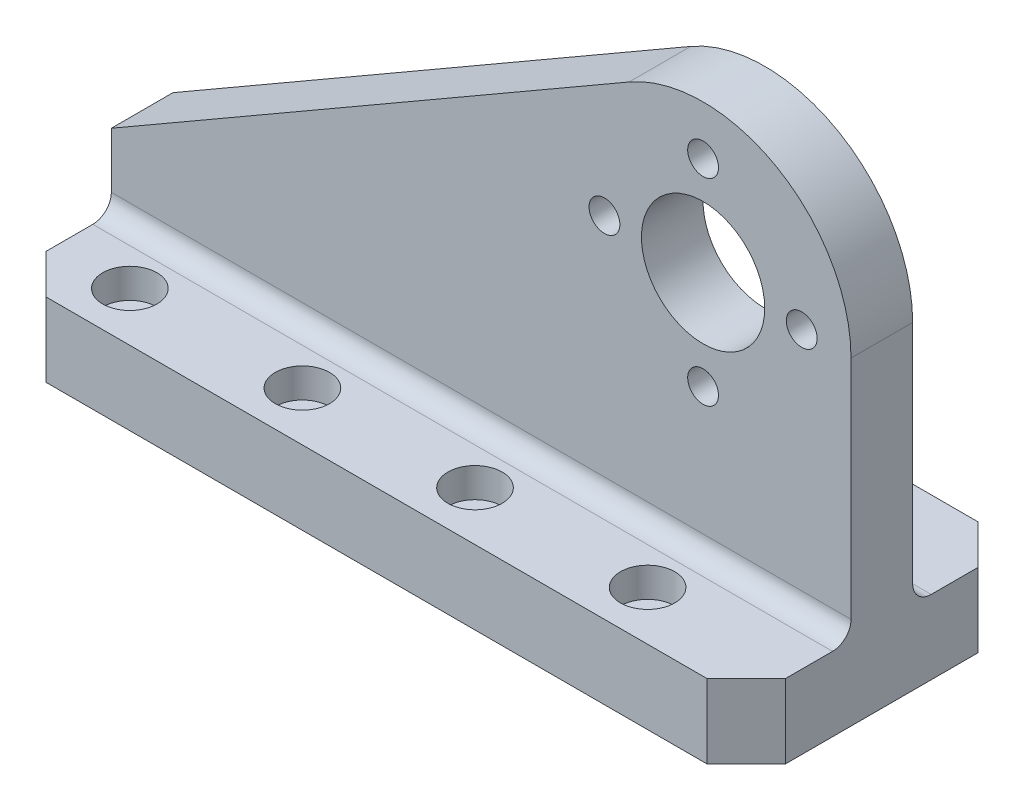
ISO-10303-21;
HEADER;
FILE_DESCRIPTION(('STEP AP214'),'2;1');
FILE_NAME('part.step','',(''),(''),'','','');
FILE_SCHEMA(('AUTOMOTIVE_DESIGN { 1 0 10303 214 1 1 1 1 }'));
ENDSEC;
DATA;
#1=APPLICATION_CONTEXT('core data for automotive mechanical design processes');
#2=APPLICATION_PROTOCOL_DEFINITION('international standard','automotive_design',2000,#1);
#3=PRODUCT_CONTEXT('',#1,'mechanical');
#4=PRODUCT('Part','Part','',(#3));
#5=PRODUCT_RELATED_PRODUCT_CATEGORY('part','',(#4));
#6=PRODUCT_DEFINITION_FORMATION('','',#4);
#7=PRODUCT_DEFINITION_CONTEXT('part definition',#1,'design');
#8=PRODUCT_DEFINITION('design','',#6,#7);
#9=PRODUCT_DEFINITION_SHAPE('','',#8);
#10=(LENGTH_UNIT() NAMED_UNIT(*) SI_UNIT(.MILLI.,.METRE.));
#11=(NAMED_UNIT(*) PLANE_ANGLE_UNIT() SI_UNIT($,.RADIAN.));
#12=(NAMED_UNIT(*) SI_UNIT($,.STERADIAN.) SOLID_ANGLE_UNIT());
#13=UNCERTAINTY_MEASURE_WITH_UNIT(LENGTH_MEASURE(1.E-05),#10,'distance_accuracy_value','');
#14=(GEOMETRIC_REPRESENTATION_CONTEXT(3) GLOBAL_UNCERTAINTY_ASSIGNED_CONTEXT((#13)) GLOBAL_UNIT_ASSIGNED_CONTEXT((#10,
#11,#12)) REPRESENTATION_CONTEXT('',''));
#15=CARTESIAN_POINT('',(0.,0.,0.));
#16=DIRECTION('',(0.,0.,1.));
#17=DIRECTION('',(1.,0.,0.));
#18=AXIS2_PLACEMENT_3D('',#15,#16,#17);
#19=CARTESIAN_POINT('',(6.,6.,7.));
#20=DIRECTION('',(0.,1.,0.));
#21=DIRECTION('',(0.,0.,1.));
#22=AXIS2_PLACEMENT_3D('',#19,#20,#21);
#23=CYLINDRICAL_SURFACE('',#22,2.2);
#24=CARTESIAN_POINT('',(6.,3.6,7.));
#25=DIRECTION('',(0.,1.,0.));
#26=DIRECTION('',(0.,0.,1.));
#27=AXIS2_PLACEMENT_3D('',#24,#25,#26);
#28=CIRCLE('',#27,2.2);
#29=CARTESIAN_POINT('',(6.,3.6,9.2));
#30=VERTEX_POINT('',#29);
#31=EDGE_CURVE('E257',#30,#30,#28,.T.);
#32=ORIENTED_EDGE('',*,*,#31,.F.);
#33=EDGE_LOOP('',(#32));
#34=FACE_BOUND('',#33,.T.);
#35=CARTESIAN_POINT('',(6.,6.,7.));
#36=DIRECTION('',(0.,1.,0.));
#37=DIRECTION('',(0.,0.,1.));
#38=AXIS2_PLACEMENT_3D('',#35,#36,#37);
#39=CIRCLE('',#38,2.2);
#40=CARTESIAN_POINT('',(6.,6.,9.2));
#41=VERTEX_POINT('',#40);
#42=EDGE_CURVE('E248',#41,#41,#39,.T.);
#43=ORIENTED_EDGE('',*,*,#42,.T.);
#44=EDGE_LOOP('',(#43));
#45=FACE_BOUND('',#44,.T.);
#46=ADVANCED_FACE('F48',(#34,#45),#23,.F.);
#47=CARTESIAN_POINT('',(7.2,3.6,7.));
#48=DIRECTION('',(0.,-1.,0.));
#49=DIRECTION('',(0.,0.,-1.));
#50=AXIS2_PLACEMENT_3D('',#47,#48,#49);
#51=PLANE('',#50);
#52=CARTESIAN_POINT('',(6.,3.6,7.));
#53=DIRECTION('',(0.,1.,0.));
#54=DIRECTION('',(0.,0.,1.));
#55=AXIS2_PLACEMENT_3D('',#52,#53,#54);
#56=CIRCLE('',#55,1.2);
#57=CARTESIAN_POINT('',(6.,3.6,8.2));
#58=VERTEX_POINT('',#57);
#59=EDGE_CURVE('E254',#58,#58,#56,.T.);
#60=ORIENTED_EDGE('',*,*,#59,.F.);
#61=EDGE_LOOP('',(#60));
#62=FACE_BOUND('',#61,.T.);
#63=ORIENTED_EDGE('',*,*,#31,.T.);
#64=EDGE_LOOP('',(#63));
#65=FACE_BOUND('',#64,.T.);
#66=ADVANCED_FACE('F372',(#62,#65),#51,.F.);
#67=CARTESIAN_POINT('',(6.,6.,7.));
#68=DIRECTION('',(0.,1.,0.));
#69=DIRECTION('',(0.,0.,1.));
#70=AXIS2_PLACEMENT_3D('',#67,#68,#69);
#71=CYLINDRICAL_SURFACE('',#70,1.2);
#72=CARTESIAN_POINT('',(6.,0.,7.));
#73=DIRECTION('',(0.,1.,0.));
#74=DIRECTION('',(0.,0.,1.));
#75=AXIS2_PLACEMENT_3D('',#72,#73,#74);
#76=CIRCLE('',#75,1.2);
#77=CARTESIAN_POINT('',(6.,0.,8.2));
#78=VERTEX_POINT('',#77);
#79=EDGE_CURVE('E251',#78,#78,#76,.T.);
#80=ORIENTED_EDGE('',*,*,#79,.F.);
#81=EDGE_LOOP('',(#80));
#82=FACE_BOUND('',#81,.T.);
#83=ORIENTED_EDGE('',*,*,#59,.T.);
#84=EDGE_LOOP('',(#83));
#85=FACE_BOUND('',#84,.T.);
#86=ADVANCED_FACE('F378',(#82,#85),#71,.F.);
#87=CARTESIAN_POINT('',(20.,6.,7.));
#88=DIRECTION('',(0.,1.,0.));
#89=DIRECTION('',(0.,0.,1.));
#90=AXIS2_PLACEMENT_3D('',#87,#88,#89);
#91=CYLINDRICAL_SURFACE('',#90,2.2);
#92=CARTESIAN_POINT('',(20.,3.6,7.));
#93=DIRECTION('',(0.,1.,0.));
#94=DIRECTION('',(0.,0.,1.));
#95=AXIS2_PLACEMENT_3D('',#92,#93,#94);
#96=CIRCLE('',#95,2.2);
#97=CARTESIAN_POINT('',(20.,3.6,9.2));
#98=VERTEX_POINT('',#97);
#99=EDGE_CURVE('E245',#98,#98,#96,.T.);
#100=ORIENTED_EDGE('',*,*,#99,.F.);
#101=EDGE_LOOP('',(#100));
#102=FACE_BOUND('',#101,.T.);
#103=CARTESIAN_POINT('',(20.,6.,7.));
#104=DIRECTION('',(0.,1.,0.));
#105=DIRECTION('',(0.,0.,1.));
#106=AXIS2_PLACEMENT_3D('',#103,#104,#105);
#107=CIRCLE('',#106,2.2);
#108=CARTESIAN_POINT('',(20.,6.,9.2));
#109=VERTEX_POINT('',#108);
#110=EDGE_CURVE('E236',#109,#109,#107,.T.);
#111=ORIENTED_EDGE('',*,*,#110,.T.);
#112=EDGE_LOOP('',(#111));
#113=FACE_BOUND('',#112,.T.);
#114=ADVANCED_FACE('F524',(#102,#113),#91,.F.);
#115=CARTESIAN_POINT('',(21.2,3.6,7.));
#116=DIRECTION('',(0.,-1.,0.));
#117=DIRECTION('',(0.,0.,-1.));
#118=AXIS2_PLACEMENT_3D('',#115,#116,#117);
#119=PLANE('',#118);
#120=CARTESIAN_POINT('',(20.,3.6,7.));
#121=DIRECTION('',(0.,1.,0.));
#122=DIRECTION('',(0.,0.,1.));
#123=AXIS2_PLACEMENT_3D('',#120,#121,#122);
#124=CIRCLE('',#123,1.2);
#125=CARTESIAN_POINT('',(20.,3.6,8.2));
#126=VERTEX_POINT('',#125);
#127=EDGE_CURVE('E242',#126,#126,#124,.T.);
#128=ORIENTED_EDGE('',*,*,#127,.F.);
#129=EDGE_LOOP('',(#128));
#130=FACE_BOUND('',#129,.T.);
#131=ORIENTED_EDGE('',*,*,#99,.T.);
#132=EDGE_LOOP('',(#131));
#133=FACE_BOUND('',#132,.T.);
#134=ADVANCED_FACE('F520',(#130,#133),#119,.F.);
#135=CARTESIAN_POINT('',(20.,6.,7.));
#136=DIRECTION('',(0.,1.,0.));
#137=DIRECTION('',(0.,0.,1.));
#138=AXIS2_PLACEMENT_3D('',#135,#136,#137);
#139=CYLINDRICAL_SURFACE('',#138,1.2);
#140=CARTESIAN_POINT('',(20.,0.,7.));
#141=DIRECTION('',(0.,1.,0.));
#142=DIRECTION('',(0.,0.,1.));
#143=AXIS2_PLACEMENT_3D('',#140,#141,#142);
#144=CIRCLE('',#143,1.2);
#145=CARTESIAN_POINT('',(20.,0.,8.2));
#146=VERTEX_POINT('',#145);
#147=EDGE_CURVE('E239',#146,#146,#144,.T.);
#148=ORIENTED_EDGE('',*,*,#147,.F.);
#149=EDGE_LOOP('',(#148));
#150=FACE_BOUND('',#149,.T.);
#151=ORIENTED_EDGE('',*,*,#127,.T.);
#152=EDGE_LOOP('',(#151));
#153=FACE_BOUND('',#152,.T.);
#154=ADVANCED_FACE('F496',(#150,#153),#139,.F.);
#155=CARTESIAN_POINT('',(48.,25.8564064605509,2.5));
#156=DIRECTION('',(0.,0.,1.));
#157=DIRECTION('',(1.,0.,0.));
#158=AXIS2_PLACEMENT_3D('',#155,#156,#157);
#159=PLANE('',#158);
#160=CARTESIAN_POINT('',(48.0000000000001,17.8564064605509,2.5));
#161=DIRECTION('',(0.,0.,1.));
#162=DIRECTION('',(1.,0.,0.));
#163=AXIS2_PLACEMENT_3D('',#160,#161,#162);
#164=CIRCLE('',#163,1.24999999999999);
#165=CARTESIAN_POINT('',(49.2500000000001,17.8564064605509,2.5));
#166=VERTEX_POINT('',#165);
#167=EDGE_CURVE('E265',#166,#166,#164,.T.);
#168=ORIENTED_EDGE('',*,*,#167,.F.);
#169=EDGE_LOOP('',(#168));
#170=FACE_BOUND('',#169,.T.);
#171=CARTESIAN_POINT('',(40.,25.8564064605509,2.5));
#172=DIRECTION('',(0.,0.,1.));
#173=DIRECTION('',(1.,0.,0.));
#174=AXIS2_PLACEMENT_3D('',#171,#172,#173);
#175=CIRCLE('',#174,1.24999999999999);
#176=CARTESIAN_POINT('',(41.25,25.8564064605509,2.5));
#177=VERTEX_POINT('',#176);
#178=EDGE_CURVE('E264',#177,#177,#175,.T.);
#179=ORIENTED_EDGE('',*,*,#178,.F.);
#180=EDGE_LOOP('',(#179));
#181=FACE_BOUND('',#180,.T.);
#182=CARTESIAN_POINT('',(48.,33.8564064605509,2.5));
#183=DIRECTION('',(0.,0.,1.));
#184=DIRECTION('',(1.,0.,0.));
#185=AXIS2_PLACEMENT_3D('',#182,#183,#184);
#186=CIRCLE('',#185,1.24999999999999);
#187=CARTESIAN_POINT('',(49.25,33.8564064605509,2.5));
#188=VERTEX_POINT('',#187);
#189=EDGE_CURVE('E917',#188,#188,#186,.T.);
#190=ORIENTED_EDGE('',*,*,#189,.F.);
#191=EDGE_LOOP('',(#190));
#192=FACE_BOUND('',#191,.T.);
#193=CARTESIAN_POINT('',(56.,25.8564064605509,2.5));
#194=DIRECTION('',(0.,0.,1.));
#195=DIRECTION('',(1.,0.,0.));
#196=AXIS2_PLACEMENT_3D('',#193,#194,#195);
#197=CIRCLE('',#196,1.24999999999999);
#198=CARTESIAN_POINT('',(57.25,25.8564064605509,2.5));
#199=VERTEX_POINT('',#198);
#200=EDGE_CURVE('E911',#199,#199,#197,.T.);
#201=ORIENTED_EDGE('',*,*,#200,.F.);
#202=EDGE_LOOP('',(#201));
#203=FACE_BOUND('',#202,.T.);
#204=DIRECTION('',(0.,-1.,0.));
#205=VECTOR('',#204,1.);
#206=CARTESIAN_POINT('',(0.,12.,2.5));
#207=LINE('',#206,#205);
#208=CARTESIAN_POINT('',(0.,12.,2.5));
#209=VERTEX_POINT('',#208);
#210=CARTESIAN_POINT('',(0.,7.5,2.5));
#211=VERTEX_POINT('',#210);
#212=EDGE_CURVE('E160',#209,#211,#207,.T.);
#213=ORIENTED_EDGE('',*,*,#212,.T.);
#214=DIRECTION('',(-1.,0.,0.));
#215=VECTOR('',#214,1.);
#216=CARTESIAN_POINT('',(60.,7.5,2.5));
#217=LINE('',#216,#215);
#218=CARTESIAN_POINT('',(60.,7.5,2.5));
#219=VERTEX_POINT('',#218);
#220=EDGE_CURVE('E69',#211,#219,#217,.F.);
#221=ORIENTED_EDGE('',*,*,#220,.T.);
#222=DIRECTION('',(0.,1.,0.));
#223=VECTOR('',#222,1.);
#224=CARTESIAN_POINT('',(60.,0.,2.5));
#225=LINE('',#224,#223);
#226=CARTESIAN_POINT('',(60.,25.8564064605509,2.5));
#227=VERTEX_POINT('',#226);
#228=EDGE_CURVE('E151',#219,#227,#225,.T.);
#229=ORIENTED_EDGE('',*,*,#228,.T.);
#230=CARTESIAN_POINT('',(48.,25.8564064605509,2.5));
#231=DIRECTION('',(0.,0.,1.));
#232=DIRECTION('',(1.,0.,0.));
#233=AXIS2_PLACEMENT_3D('',#230,#231,#232);
#234=CIRCLE('',#233,12.);
#235=CARTESIAN_POINT('',(42.,36.2487113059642,2.5));
#236=VERTEX_POINT('',#235);
#237=EDGE_CURVE('E156',#227,#236,#234,.T.);
#238=ORIENTED_EDGE('',*,*,#237,.T.);
#239=DIRECTION('',(-0.86602540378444,-0.499999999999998,0.));
#240=VECTOR('',#239,1.);
#241=CARTESIAN_POINT('',(42.,36.2487113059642,2.5));
#242=LINE('',#241,#240);
#243=EDGE_CURVE('E176',#236,#209,#242,.T.);
#244=ORIENTED_EDGE('',*,*,#243,.T.);
#245=EDGE_LOOP('',(#213,#221,#229,#238,#244));
#246=FACE_BOUND('',#245,.T.);
#247=CARTESIAN_POINT('',(48.,25.8564064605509,2.5));
#248=DIRECTION('',(0.,0.,1.));
#249=DIRECTION('',(1.,0.,0.));
#250=AXIS2_PLACEMENT_3D('',#247,#248,#249);
#251=CIRCLE('',#250,5.);
#252=CARTESIAN_POINT('',(53.,25.8564064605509,2.5));
#253=VERTEX_POINT('',#252);
#254=EDGE_CURVE('E185',#253,#253,#251,.T.);
#255=ORIENTED_EDGE('',*,*,#254,.F.);
#256=EDGE_LOOP('',(#255));
#257=FACE_BOUND('',#256,.T.);
#258=ADVANCED_FACE('F153',(#170,#181,#192,#203,#246,#257),#159,.T.);
#259=CARTESIAN_POINT('',(48.,25.8564064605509,-2.5));
#260=DIRECTION('',(0.,0.,1.));
#261=DIRECTION('',(1.,0.,0.));
#262=AXIS2_PLACEMENT_3D('',#259,#260,#261);
#263=PLANE('',#262);
#264=CARTESIAN_POINT('',(48.0000000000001,17.8564064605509,-2.5));
#265=DIRECTION('',(0.,0.,1.));
#266=DIRECTION('',(1.,0.,0.));
#267=AXIS2_PLACEMENT_3D('',#264,#265,#266);
#268=CIRCLE('',#267,1.24999999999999);
#269=CARTESIAN_POINT('',(49.2500000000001,17.8564064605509,-2.5));
#270=VERTEX_POINT('',#269);
#271=EDGE_CURVE('E261',#270,#270,#268,.T.);
#272=ORIENTED_EDGE('',*,*,#271,.T.);
#273=EDGE_LOOP('',(#272));
#274=FACE_BOUND('',#273,.T.);
#275=CARTESIAN_POINT('',(40.,25.8564064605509,-2.5));
#276=DIRECTION('',(0.,0.,1.));
#277=DIRECTION('',(1.,0.,0.));
#278=AXIS2_PLACEMENT_3D('',#275,#276,#277);
#279=CIRCLE('',#278,1.24999999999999);
#280=CARTESIAN_POINT('',(41.25,25.8564064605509,-2.5));
#281=VERTEX_POINT('',#280);
#282=EDGE_CURVE('E920',#281,#281,#279,.T.);
#283=ORIENTED_EDGE('',*,*,#282,.T.);
#284=EDGE_LOOP('',(#283));
#285=FACE_BOUND('',#284,.T.);
#286=CARTESIAN_POINT('',(48.,33.8564064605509,-2.5));
#287=DIRECTION('',(0.,0.,1.));
#288=DIRECTION('',(1.,0.,0.));
#289=AXIS2_PLACEMENT_3D('',#286,#287,#288);
#290=CIRCLE('',#289,1.24999999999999);
#291=CARTESIAN_POINT('',(49.25,33.8564064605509,-2.5));
#292=VERTEX_POINT('',#291);
#293=EDGE_CURVE('E914',#292,#292,#290,.T.);
#294=ORIENTED_EDGE('',*,*,#293,.T.);
#295=EDGE_LOOP('',(#294));
#296=FACE_BOUND('',#295,.T.);
#297=CARTESIAN_POINT('',(56.,25.8564064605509,-2.5));
#298=DIRECTION('',(0.,0.,1.));
#299=DIRECTION('',(1.,0.,0.));
#300=AXIS2_PLACEMENT_3D('',#297,#298,#299);
#301=CIRCLE('',#300,1.24999999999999);
#302=CARTESIAN_POINT('',(57.25,25.8564064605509,-2.5));
#303=VERTEX_POINT('',#302);
#304=EDGE_CURVE('E908',#303,#303,#301,.T.);
#305=ORIENTED_EDGE('',*,*,#304,.T.);
#306=EDGE_LOOP('',(#305));
#307=FACE_BOUND('',#306,.T.);
#308=DIRECTION('',(0.,1.,0.));
#309=VECTOR('',#308,1.);
#310=CARTESIAN_POINT('',(60.,0.,-2.5));
#311=LINE('',#310,#309);
#312=CARTESIAN_POINT('',(60.,7.5,-2.5));
#313=VERTEX_POINT('',#312);
#314=CARTESIAN_POINT('',(60.,25.8564064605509,-2.5));
#315=VERTEX_POINT('',#314);
#316=EDGE_CURVE('E167',#313,#315,#311,.T.);
#317=ORIENTED_EDGE('',*,*,#316,.F.);
#318=DIRECTION('',(-1.,0.,0.));
#319=VECTOR('',#318,1.);
#320=CARTESIAN_POINT('',(48.,7.5,-2.5));
#321=LINE('',#320,#319);
#322=CARTESIAN_POINT('',(0.,7.5,-2.5));
#323=VERTEX_POINT('',#322);
#324=EDGE_CURVE('E260',#313,#323,#321,.T.);
#325=ORIENTED_EDGE('',*,*,#324,.T.);
#326=DIRECTION('',(0.,-1.,0.));
#327=VECTOR('',#326,1.);
#328=CARTESIAN_POINT('',(0.,12.,-2.5));
#329=LINE('',#328,#327);
#330=CARTESIAN_POINT('',(0.,12.,-2.5));
#331=VERTEX_POINT('',#330);
#332=EDGE_CURVE('E182',#331,#323,#329,.T.);
#333=ORIENTED_EDGE('',*,*,#332,.F.);
#334=DIRECTION('',(-0.86602540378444,-0.499999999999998,0.));
#335=VECTOR('',#334,1.);
#336=CARTESIAN_POINT('',(42.,36.2487113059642,-2.5));
#337=LINE('',#336,#335);
#338=CARTESIAN_POINT('',(42.,36.2487113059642,-2.5));
#339=VERTEX_POINT('',#338);
#340=EDGE_CURVE('E189',#339,#331,#337,.T.);
#341=ORIENTED_EDGE('',*,*,#340,.F.);
#342=CARTESIAN_POINT('',(48.,25.8564064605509,-2.5));
#343=DIRECTION('',(0.,0.,1.));
#344=DIRECTION('',(1.,0.,0.));
#345=AXIS2_PLACEMENT_3D('',#342,#343,#344);
#346=CIRCLE('',#345,12.);
#347=EDGE_CURVE('E187',#315,#339,#346,.T.);
#348=ORIENTED_EDGE('',*,*,#347,.F.);
#349=EDGE_LOOP('',(#317,#325,#333,#341,#348));
#350=FACE_BOUND('',#349,.T.);
#351=CARTESIAN_POINT('',(48.,25.8564064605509,-2.5));
#352=DIRECTION('',(0.,0.,1.));
#353=DIRECTION('',(1.,0.,0.));
#354=AXIS2_PLACEMENT_3D('',#351,#352,#353);
#355=CIRCLE('',#354,5.);
#356=CARTESIAN_POINT('',(53.,25.8564064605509,-2.5));
#357=VERTEX_POINT('',#356);
#358=EDGE_CURVE('E313',#357,#357,#355,.T.);
#359=ORIENTED_EDGE('',*,*,#358,.T.);
#360=EDGE_LOOP('',(#359));
#361=FACE_BOUND('',#360,.T.);
#362=ADVANCED_FACE('F284',(#274,#285,#296,#307,#350,#361),#263,.F.);
#363=CARTESIAN_POINT('',(0.,12.,2.5));
#364=DIRECTION('',(1.,0.,0.));
#365=DIRECTION('',(0.,1.,0.));
#366=AXIS2_PLACEMENT_3D('',#363,#364,#365);
#367=PLANE('',#366);
#368=DIRECTION('',(0.,0.,1.));
#369=VECTOR('',#368,1.);
#370=CARTESIAN_POINT('',(0.,6.,-11.));
#371=LINE('',#370,#369);
#372=CARTESIAN_POINT('',(0.,6.,-7.79999999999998));
#373=VERTEX_POINT('',#372);
#374=CARTESIAN_POINT('',(0.,6.,-4.));
#375=VERTEX_POINT('',#374);
#376=EDGE_CURVE('E292',#373,#375,#371,.T.);
#377=ORIENTED_EDGE('',*,*,#376,.F.);
#378=DIRECTION('',(0.,-1.,0.));
#379=VECTOR('',#378,1.);
#380=CARTESIAN_POINT('',(0.,12.,-7.79999999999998));
#381=LINE('',#380,#379);
#382=CARTESIAN_POINT('',(0.,0.,-7.79999999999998));
#383=VERTEX_POINT('',#382);
#384=EDGE_CURVE('E201',#373,#383,#381,.T.);
#385=ORIENTED_EDGE('',*,*,#384,.T.);
#386=DIRECTION('',(0.,0.,-1.));
#387=VECTOR('',#386,1.);
#388=CARTESIAN_POINT('',(0.,0.,2.5));
#389=LINE('',#388,#387);
#390=CARTESIAN_POINT('',(0.,0.,7.79999999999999));
#391=VERTEX_POINT('',#390);
#392=EDGE_CURVE('E195',#391,#383,#389,.T.);
#393=ORIENTED_EDGE('',*,*,#392,.F.);
#394=DIRECTION('',(0.,1.,0.));
#395=VECTOR('',#394,1.);
#396=CARTESIAN_POINT('',(0.,12.,7.79999999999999));
#397=LINE('',#396,#395);
#398=CARTESIAN_POINT('',(0.,6.,7.79999999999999));
#399=VERTEX_POINT('',#398);
#400=EDGE_CURVE('E198',#391,#399,#397,.T.);
#401=ORIENTED_EDGE('',*,*,#400,.T.);
#402=CARTESIAN_POINT('',(0.,6.,4.));
#403=VERTEX_POINT('',#402);
#404=EDGE_CURVE('E299',#403,#399,#371,.T.);
#405=ORIENTED_EDGE('',*,*,#404,.F.);
#406=CARTESIAN_POINT('',(0.,7.5,4.));
#407=DIRECTION('',(1.,0.,0.));
#408=DIRECTION('',(0.,1.,0.));
#409=AXIS2_PLACEMENT_3D('',#406,#407,#408);
#410=CIRCLE('',#409,1.5);
#411=EDGE_CURVE('E56',#403,#211,#410,.T.);
#412=ORIENTED_EDGE('',*,*,#411,.T.);
#413=ORIENTED_EDGE('',*,*,#212,.F.);
#414=DIRECTION('',(0.,0.,-1.));
#415=VECTOR('',#414,1.);
#416=CARTESIAN_POINT('',(0.,12.,2.5));
#417=LINE('',#416,#415);
#418=EDGE_CURVE('E178',#209,#331,#417,.T.);
#419=ORIENTED_EDGE('',*,*,#418,.T.);
#420=ORIENTED_EDGE('',*,*,#332,.T.);
#421=CARTESIAN_POINT('',(0.,7.5,-4.));
#422=DIRECTION('',(1.,0.,0.));
#423=DIRECTION('',(0.,1.,0.));
#424=AXIS2_PLACEMENT_3D('',#421,#422,#423);
#425=CIRCLE('',#424,1.5);
#426=EDGE_CURVE('E274',#323,#375,#425,.T.);
#427=ORIENTED_EDGE('',*,*,#426,.T.);
#428=EDGE_LOOP('',(#377,#385,#393,#401,#405,#412,#413,#419,#420,#427));
#429=FACE_BOUND('',#428,.T.);
#430=ADVANCED_FACE('F291',(#429),#367,.F.);
#431=CARTESIAN_POINT('',(0.,0.,2.5));
#432=DIRECTION('',(0.,1.,0.));
#433=DIRECTION('',(0.,0.,1.));
#434=AXIS2_PLACEMENT_3D('',#431,#432,#433);
#435=PLANE('',#434);
#436=CARTESIAN_POINT('',(6.,0.,-7.));
#437=DIRECTION('',(0.,1.,0.));
#438=DIRECTION('',(0.,0.,1.));
#439=AXIS2_PLACEMENT_3D('',#436,#437,#438);
#440=CIRCLE('',#439,1.2);
#441=CARTESIAN_POINT('',(6.,0.,-5.8));
#442=VERTEX_POINT('',#441);
#443=EDGE_CURVE('E828',#442,#442,#440,.T.);
#444=ORIENTED_EDGE('',*,*,#443,.T.);
#445=EDGE_LOOP('',(#444));
#446=FACE_BOUND('',#445,.T.);
#447=CARTESIAN_POINT('',(20.,0.,-7.));
#448=DIRECTION('',(0.,1.,0.));
#449=DIRECTION('',(0.,0.,1.));
#450=AXIS2_PLACEMENT_3D('',#447,#448,#449);
#451=CIRCLE('',#450,1.2);
#452=CARTESIAN_POINT('',(20.,0.,-5.8));
#453=VERTEX_POINT('',#452);
#454=EDGE_CURVE('E832',#453,#453,#451,.T.);
#455=ORIENTED_EDGE('',*,*,#454,.T.);
#456=EDGE_LOOP('',(#455));
#457=FACE_BOUND('',#456,.T.);
#458=CARTESIAN_POINT('',(34.,0.,-7.));
#459=DIRECTION('',(0.,1.,0.));
#460=DIRECTION('',(0.,0.,1.));
#461=AXIS2_PLACEMENT_3D('',#458,#459,#460);
#462=CIRCLE('',#461,1.2);
#463=CARTESIAN_POINT('',(34.,0.,-5.8));
#464=VERTEX_POINT('',#463);
#465=EDGE_CURVE('E836',#464,#464,#462,.T.);
#466=ORIENTED_EDGE('',*,*,#465,.T.);
#467=EDGE_LOOP('',(#466));
#468=FACE_BOUND('',#467,.T.);
#469=CARTESIAN_POINT('',(48.,0.,-7.));
#470=DIRECTION('',(0.,1.,0.));
#471=DIRECTION('',(0.,0.,1.));
#472=AXIS2_PLACEMENT_3D('',#469,#470,#471);
#473=CIRCLE('',#472,1.2);
#474=CARTESIAN_POINT('',(48.,0.,-5.8));
#475=VERTEX_POINT('',#474);
#476=EDGE_CURVE('E840',#475,#475,#473,.T.);
#477=ORIENTED_EDGE('',*,*,#476,.T.);
#478=EDGE_LOOP('',(#477));
#479=FACE_BOUND('',#478,.T.);
#480=CARTESIAN_POINT('',(34.,0.,7.));
#481=DIRECTION('',(0.,1.,0.));
#482=DIRECTION('',(0.,0.,1.));
#483=AXIS2_PLACEMENT_3D('',#480,#481,#482);
#484=CIRCLE('',#483,1.2);
#485=CARTESIAN_POINT('',(34.,0.,8.2));
#486=VERTEX_POINT('',#485);
#487=EDGE_CURVE('E844',#486,#486,#484,.T.);
#488=ORIENTED_EDGE('',*,*,#487,.T.);
#489=EDGE_LOOP('',(#488));
#490=FACE_BOUND('',#489,.T.);
#491=CARTESIAN_POINT('',(48.,0.,7.));
#492=DIRECTION('',(0.,1.,0.));
#493=DIRECTION('',(0.,0.,1.));
#494=AXIS2_PLACEMENT_3D('',#491,#492,#493);
#495=CIRCLE('',#494,1.2);
#496=CARTESIAN_POINT('',(48.,0.,8.2));
#497=VERTEX_POINT('',#496);
#498=EDGE_CURVE('E305',#497,#497,#495,.T.);
#499=ORIENTED_EDGE('',*,*,#498,.T.);
#500=EDGE_LOOP('',(#499));
#501=FACE_BOUND('',#500,.T.);
#502=ORIENTED_EDGE('',*,*,#392,.T.);
#503=DIRECTION('',(-0.707106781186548,0.,0.707106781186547));
#504=VECTOR('',#503,1.);
#505=CARTESIAN_POINT('',(0.,0.,-7.79999999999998));
#506=LINE('',#505,#504);
#507=CARTESIAN_POINT('',(3.20000000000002,0.,-11.));
#508=VERTEX_POINT('',#507);
#509=EDGE_CURVE('E210',#383,#508,#506,.F.);
#510=ORIENTED_EDGE('',*,*,#509,.T.);
#511=DIRECTION('',(-1.,0.,0.));
#512=VECTOR('',#511,1.);
#513=CARTESIAN_POINT('',(0.,0.,-11.));
#514=LINE('',#513,#512);
#515=CARTESIAN_POINT('',(56.8,0.,-11.));
#516=VERTEX_POINT('',#515);
#517=EDGE_CURVE('E303',#516,#508,#514,.T.);
#518=ORIENTED_EDGE('',*,*,#517,.F.);
#519=DIRECTION('',(-0.707106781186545,0.,-0.70710678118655));
#520=VECTOR('',#519,1.);
#521=CARTESIAN_POINT('',(56.8,0.,-11.));
#522=LINE('',#521,#520);
#523=CARTESIAN_POINT('',(60.,0.,-7.8));
#524=VERTEX_POINT('',#523);
#525=EDGE_CURVE('E208',#516,#524,#522,.F.);
#526=ORIENTED_EDGE('',*,*,#525,.T.);
#527=DIRECTION('',(0.,0.,-1.));
#528=VECTOR('',#527,1.);
#529=CARTESIAN_POINT('',(60.,0.,2.5));
#530=LINE('',#529,#528);
#531=CARTESIAN_POINT('',(60.,0.,7.79999999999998));
#532=VERTEX_POINT('',#531);
#533=EDGE_CURVE('E170',#532,#524,#530,.T.);
#534=ORIENTED_EDGE('',*,*,#533,.F.);
#535=DIRECTION('',(0.707106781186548,0.,-0.707106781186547));
#536=VECTOR('',#535,1.);
#537=CARTESIAN_POINT('',(60.,0.,7.79999999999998));
#538=LINE('',#537,#536);
#539=CARTESIAN_POINT('',(56.8,0.,11.));
#540=VERTEX_POINT('',#539);
#541=EDGE_CURVE('E204',#532,#540,#538,.F.);
#542=ORIENTED_EDGE('',*,*,#541,.T.);
#543=DIRECTION('',(1.,0.,0.));
#544=VECTOR('',#543,1.);
#545=CARTESIAN_POINT('',(0.,0.,11.));
#546=LINE('',#545,#544);
#547=CARTESIAN_POINT('',(3.19999999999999,0.,11.));
#548=VERTEX_POINT('',#547);
#549=EDGE_CURVE('E314',#548,#540,#546,.T.);
#550=ORIENTED_EDGE('',*,*,#549,.F.);
#551=DIRECTION('',(0.707106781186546,0.,0.707106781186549));
#552=VECTOR('',#551,1.);
#553=CARTESIAN_POINT('',(3.19999999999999,0.,11.));
#554=LINE('',#553,#552);
#555=EDGE_CURVE('E206',#548,#391,#554,.F.);
#556=ORIENTED_EDGE('',*,*,#555,.T.);
#557=EDGE_LOOP('',(#502,#510,#518,#526,#534,#542,#550,#556));
#558=FACE_BOUND('',#557,.T.);
#559=ORIENTED_EDGE('',*,*,#147,.T.);
#560=EDGE_LOOP('',(#559));
#561=FACE_BOUND('',#560,.T.);
#562=ORIENTED_EDGE('',*,*,#79,.T.);
#563=EDGE_LOOP('',(#562));
#564=FACE_BOUND('',#563,.T.);
#565=ADVANCED_FACE('F338',(#446,#457,#468,#479,#490,#501,#558,#561,#564),#435,.F.);
#566=CARTESIAN_POINT('',(60.,0.,2.5));
#567=DIRECTION('',(-1.,0.,0.));
#568=DIRECTION('',(0.,0.,1.));
#569=AXIS2_PLACEMENT_3D('',#566,#567,#568);
#570=PLANE('',#569);
#571=ORIENTED_EDGE('',*,*,#533,.T.);
#572=DIRECTION('',(0.,1.,0.));
#573=VECTOR('',#572,1.);
#574=CARTESIAN_POINT('',(60.,0.,-7.8));
#575=LINE('',#574,#573);
#576=CARTESIAN_POINT('',(60.,6.,-7.8));
#577=VERTEX_POINT('',#576);
#578=EDGE_CURVE('E224',#524,#577,#575,.T.);
#579=ORIENTED_EDGE('',*,*,#578,.T.);
#580=DIRECTION('',(0.,0.,-1.));
#581=VECTOR('',#580,1.);
#582=CARTESIAN_POINT('',(60.,6.,-11.));
#583=LINE('',#582,#581);
#584=CARTESIAN_POINT('',(60.,6.,-4.));
#585=VERTEX_POINT('',#584);
#586=EDGE_CURVE('E279',#585,#577,#583,.T.);
#587=ORIENTED_EDGE('',*,*,#586,.F.);
#588=CARTESIAN_POINT('',(60.,7.5,-4.));
#589=DIRECTION('',(-1.,0.,0.));
#590=DIRECTION('',(0.,0.,1.));
#591=AXIS2_PLACEMENT_3D('',#588,#589,#590);
#592=CIRCLE('',#591,1.5);
#593=EDGE_CURVE('E276',#585,#313,#592,.T.);
#594=ORIENTED_EDGE('',*,*,#593,.T.);
#595=ORIENTED_EDGE('',*,*,#316,.T.);
#596=DIRECTION('',(0.,0.,-1.));
#597=VECTOR('',#596,1.);
#598=CARTESIAN_POINT('',(60.,25.8564064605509,2.5));
#599=LINE('',#598,#597);
#600=EDGE_CURVE('E163',#227,#315,#599,.T.);
#601=ORIENTED_EDGE('',*,*,#600,.F.);
#602=ORIENTED_EDGE('',*,*,#228,.F.);
#603=CARTESIAN_POINT('',(60.,7.5,4.));
#604=DIRECTION('',(-1.,0.,0.));
#605=DIRECTION('',(0.,0.,1.));
#606=AXIS2_PLACEMENT_3D('',#603,#604,#605);
#607=CIRCLE('',#606,1.5);
#608=CARTESIAN_POINT('',(60.,6.,4.));
#609=VERTEX_POINT('',#608);
#610=EDGE_CURVE('E13',#219,#609,#607,.T.);
#611=ORIENTED_EDGE('',*,*,#610,.T.);
#612=CARTESIAN_POINT('',(60.,6.,7.79999999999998));
#613=VERTEX_POINT('',#612);
#614=EDGE_CURVE('E308',#613,#609,#583,.T.);
#615=ORIENTED_EDGE('',*,*,#614,.F.);
#616=DIRECTION('',(0.,-1.,0.));
#617=VECTOR('',#616,1.);
#618=CARTESIAN_POINT('',(60.,0.,7.79999999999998));
#619=LINE('',#618,#617);
#620=EDGE_CURVE('E221',#613,#532,#619,.T.);
#621=ORIENTED_EDGE('',*,*,#620,.T.);
#622=EDGE_LOOP('',(#571,#579,#587,#594,#595,#601,#602,#611,#615,#621));
#623=FACE_BOUND('',#622,.T.);
#624=ADVANCED_FACE('F165',(#623),#570,.F.);
#625=CARTESIAN_POINT('',(48.,25.8564064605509,2.5));
#626=DIRECTION('',(0.,0.,-1.));
#627=DIRECTION('',(-1.,0.,0.));
#628=AXIS2_PLACEMENT_3D('',#625,#626,#627);
#629=CYLINDRICAL_SURFACE('',#628,12.);
#630=ORIENTED_EDGE('',*,*,#347,.T.);
#631=DIRECTION('',(0.,0.,-1.));
#632=VECTOR('',#631,1.);
#633=CARTESIAN_POINT('',(42.,36.2487113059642,2.5));
#634=LINE('',#633,#632);
#635=EDGE_CURVE('E171',#236,#339,#634,.T.);
#636=ORIENTED_EDGE('',*,*,#635,.F.);
#637=ORIENTED_EDGE('',*,*,#237,.F.);
#638=ORIENTED_EDGE('',*,*,#600,.T.);
#639=EDGE_LOOP('',(#630,#636,#637,#638));
#640=FACE_BOUND('',#639,.T.);
#641=ADVANCED_FACE('F173',(#640),#629,.T.);
#642=CARTESIAN_POINT('',(42.,36.2487113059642,2.5));
#643=DIRECTION('',(0.499999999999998,-0.86602540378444,0.));
#644=DIRECTION('',(0.86602540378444,0.499999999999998,0.));
#645=AXIS2_PLACEMENT_3D('',#642,#643,#644);
#646=PLANE('',#645);
#647=ORIENTED_EDGE('',*,*,#340,.T.);
#648=ORIENTED_EDGE('',*,*,#418,.F.);
#649=ORIENTED_EDGE('',*,*,#243,.F.);
#650=ORIENTED_EDGE('',*,*,#635,.T.);
#651=EDGE_LOOP('',(#647,#648,#649,#650));
#652=FACE_BOUND('',#651,.T.);
#653=ADVANCED_FACE('F485',(#652),#646,.F.);
#654=CARTESIAN_POINT('',(48.,25.8564064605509,2.5));
#655=DIRECTION('',(0.,0.,-1.));
#656=DIRECTION('',(-1.,0.,0.));
#657=AXIS2_PLACEMENT_3D('',#654,#655,#656);
#658=CYLINDRICAL_SURFACE('',#657,5.);
#659=ORIENTED_EDGE('',*,*,#254,.T.);
#660=EDGE_LOOP('',(#659));
#661=FACE_BOUND('',#660,.T.);
#662=ORIENTED_EDGE('',*,*,#358,.F.);
#663=EDGE_LOOP('',(#662));
#664=FACE_BOUND('',#663,.T.);
#665=ADVANCED_FACE('F481',(#661,#664),#658,.F.);
#666=CARTESIAN_POINT('',(0.,6.,-11.));
#667=DIRECTION('',(0.,0.,1.));
#668=DIRECTION('',(1.,0.,0.));
#669=AXIS2_PLACEMENT_3D('',#666,#667,#668);
#670=PLANE('',#669);
#671=ORIENTED_EDGE('',*,*,#517,.T.);
#672=DIRECTION('',(0.,1.,0.));
#673=VECTOR('',#672,1.);
#674=CARTESIAN_POINT('',(3.20000000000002,6.,-11.));
#675=LINE('',#674,#673);
#676=CARTESIAN_POINT('',(3.20000000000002,6.,-11.));
#677=VERTEX_POINT('',#676);
#678=EDGE_CURVE('E215',#508,#677,#675,.T.);
#679=ORIENTED_EDGE('',*,*,#678,.T.);
#680=DIRECTION('',(-1.,0.,0.));
#681=VECTOR('',#680,1.);
#682=CARTESIAN_POINT('',(0.,6.,-11.));
#683=LINE('',#682,#681);
#684=CARTESIAN_POINT('',(56.8,6.,-11.));
#685=VERTEX_POINT('',#684);
#686=EDGE_CURVE('E311',#685,#677,#683,.T.);
#687=ORIENTED_EDGE('',*,*,#686,.F.);
#688=DIRECTION('',(0.,-1.,0.));
#689=VECTOR('',#688,1.);
#690=CARTESIAN_POINT('',(56.8,6.,-11.));
#691=LINE('',#690,#689);
#692=EDGE_CURVE('E212',#685,#516,#691,.T.);
#693=ORIENTED_EDGE('',*,*,#692,.T.);
#694=EDGE_LOOP('',(#671,#679,#687,#693));
#695=FACE_BOUND('',#694,.T.);
#696=ADVANCED_FACE('F348',(#695),#670,.F.);
#697=CARTESIAN_POINT('',(0.,6.,0.));
#698=DIRECTION('',(0.,1.,0.));
#699=DIRECTION('',(0.,0.,1.));
#700=AXIS2_PLACEMENT_3D('',#697,#698,#699);
#701=PLANE('',#700);
#702=CARTESIAN_POINT('',(6.,6.,-7.));
#703=DIRECTION('',(0.,1.,0.));
#704=DIRECTION('',(0.,0.,1.));
#705=AXIS2_PLACEMENT_3D('',#702,#703,#704);
#706=CIRCLE('',#705,2.2);
#707=CARTESIAN_POINT('',(6.,6.,-4.8));
#708=VERTEX_POINT('',#707);
#709=EDGE_CURVE('E905',#708,#708,#706,.T.);
#710=ORIENTED_EDGE('',*,*,#709,.F.);
#711=EDGE_LOOP('',(#710));
#712=FACE_BOUND('',#711,.T.);
#713=CARTESIAN_POINT('',(20.,6.,-7.));
#714=DIRECTION('',(0.,1.,0.));
#715=DIRECTION('',(0.,0.,1.));
#716=AXIS2_PLACEMENT_3D('',#713,#714,#715);
#717=CIRCLE('',#716,2.2);
#718=CARTESIAN_POINT('',(20.,6.,-4.8));
#719=VERTEX_POINT('',#718);
#720=EDGE_CURVE('E895',#719,#719,#717,.T.);
#721=ORIENTED_EDGE('',*,*,#720,.F.);
#722=EDGE_LOOP('',(#721));
#723=FACE_BOUND('',#722,.T.);
#724=CARTESIAN_POINT('',(34.,6.,-7.));
#725=DIRECTION('',(0.,1.,0.));
#726=DIRECTION('',(0.,0.,1.));
#727=AXIS2_PLACEMENT_3D('',#724,#725,#726);
#728=CIRCLE('',#727,2.2);
#729=CARTESIAN_POINT('',(34.,6.,-4.8));
#730=VERTEX_POINT('',#729);
#731=EDGE_CURVE('E885',#730,#730,#728,.T.);
#732=ORIENTED_EDGE('',*,*,#731,.F.);
#733=EDGE_LOOP('',(#732));
#734=FACE_BOUND('',#733,.T.);
#735=CARTESIAN_POINT('',(48.,6.,-7.));
#736=DIRECTION('',(0.,1.,0.));
#737=DIRECTION('',(0.,0.,1.));
#738=AXIS2_PLACEMENT_3D('',#735,#736,#737);
#739=CIRCLE('',#738,2.2);
#740=CARTESIAN_POINT('',(48.,6.,-4.8));
#741=VERTEX_POINT('',#740);
#742=EDGE_CURVE('E875',#741,#741,#739,.T.);
#743=ORIENTED_EDGE('',*,*,#742,.F.);
#744=EDGE_LOOP('',(#743));
#745=FACE_BOUND('',#744,.T.);
#746=ORIENTED_EDGE('',*,*,#376,.T.);
#747=DIRECTION('',(-1.,0.,0.));
#748=VECTOR('',#747,1.);
#749=CARTESIAN_POINT('',(0.,6.,-4.));
#750=LINE('',#749,#748);
#751=EDGE_CURVE('E268',#375,#585,#750,.F.);
#752=ORIENTED_EDGE('',*,*,#751,.T.);
#753=ORIENTED_EDGE('',*,*,#586,.T.);
#754=DIRECTION('',(0.707106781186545,0.,0.70710678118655));
#755=VECTOR('',#754,1.);
#756=CARTESIAN_POINT('',(33.9000000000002,6.,-33.9));
#757=LINE('',#756,#755);
#758=EDGE_CURVE('E217',#577,#685,#757,.F.);
#759=ORIENTED_EDGE('',*,*,#758,.T.);
#760=ORIENTED_EDGE('',*,*,#686,.T.);
#761=DIRECTION('',(0.707106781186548,0.,-0.707106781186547));
#762=VECTOR('',#761,1.);
#763=CARTESIAN_POINT('',(-3.89999999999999,6.,-3.9));
#764=LINE('',#763,#762);
#765=EDGE_CURVE('E219',#677,#373,#764,.F.);
#766=ORIENTED_EDGE('',*,*,#765,.T.);
#767=EDGE_LOOP('',(#746,#752,#753,#759,#760,#766));
#768=FACE_BOUND('',#767,.T.);
#769=ADVANCED_FACE('F295',(#712,#723,#734,#745,#768),#701,.T.);
#770=CARTESIAN_POINT('',(0.,6.,11.));
#771=DIRECTION('',(0.,0.,-1.));
#772=DIRECTION('',(-1.,0.,0.));
#773=AXIS2_PLACEMENT_3D('',#770,#771,#772);
#774=PLANE('',#773);
#775=DIRECTION('',(1.,0.,0.));
#776=VECTOR('',#775,1.);
#777=CARTESIAN_POINT('',(0.,6.,11.));
#778=LINE('',#777,#776);
#779=CARTESIAN_POINT('',(3.19999999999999,6.,11.));
#780=VERTEX_POINT('',#779);
#781=CARTESIAN_POINT('',(56.8,6.,11.));
#782=VERTEX_POINT('',#781);
#783=EDGE_CURVE('E298',#780,#782,#778,.T.);
#784=ORIENTED_EDGE('',*,*,#783,.F.);
#785=DIRECTION('',(0.,-1.,0.));
#786=VECTOR('',#785,1.);
#787=CARTESIAN_POINT('',(3.19999999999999,6.,11.));
#788=LINE('',#787,#786);
#789=EDGE_CURVE('E229',#780,#548,#788,.T.);
#790=ORIENTED_EDGE('',*,*,#789,.T.);
#791=ORIENTED_EDGE('',*,*,#549,.T.);
#792=DIRECTION('',(0.,1.,0.));
#793=VECTOR('',#792,1.);
#794=CARTESIAN_POINT('',(56.8,6.,11.));
#795=LINE('',#794,#793);
#796=EDGE_CURVE('E227',#540,#782,#795,.T.);
#797=ORIENTED_EDGE('',*,*,#796,.T.);
#798=EDGE_LOOP('',(#784,#790,#791,#797));
#799=FACE_BOUND('',#798,.T.);
#800=ADVANCED_FACE('F359',(#799),#774,.F.);
#801=CARTESIAN_POINT('',(34.,6.,7.));
#802=DIRECTION('',(0.,1.,0.));
#803=DIRECTION('',(0.,0.,1.));
#804=AXIS2_PLACEMENT_3D('',#801,#802,#803);
#805=CIRCLE('',#804,2.2);
#806=CARTESIAN_POINT('',(34.,6.,9.2));
#807=VERTEX_POINT('',#806);
#808=EDGE_CURVE('E865',#807,#807,#805,.T.);
#809=ORIENTED_EDGE('',*,*,#808,.F.);
#810=EDGE_LOOP('',(#809));
#811=FACE_BOUND('',#810,.T.);
#812=CARTESIAN_POINT('',(48.,6.,7.));
#813=DIRECTION('',(0.,1.,0.));
#814=DIRECTION('',(0.,0.,1.));
#815=AXIS2_PLACEMENT_3D('',#812,#813,#814);
#816=CIRCLE('',#815,2.2);
#817=CARTESIAN_POINT('',(48.,6.,9.2));
#818=VERTEX_POINT('',#817);
#819=EDGE_CURVE('E853',#818,#818,#816,.T.);
#820=ORIENTED_EDGE('',*,*,#819,.F.);
#821=EDGE_LOOP('',(#820));
#822=FACE_BOUND('',#821,.T.);
#823=ORIENTED_EDGE('',*,*,#614,.T.);
#824=DIRECTION('',(-1.,0.,0.));
#825=VECTOR('',#824,1.);
#826=CARTESIAN_POINT('',(0.,6.,4.));
#827=LINE('',#826,#825);
#828=EDGE_CURVE('E270',#609,#403,#827,.T.);
#829=ORIENTED_EDGE('',*,*,#828,.T.);
#830=ORIENTED_EDGE('',*,*,#404,.T.);
#831=DIRECTION('',(-0.707106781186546,0.,-0.707106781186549));
#832=VECTOR('',#831,1.);
#833=CARTESIAN_POINT('',(-3.9,6.,3.89999999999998));
#834=LINE('',#833,#832);
#835=EDGE_CURVE('E234',#399,#780,#834,.F.);
#836=ORIENTED_EDGE('',*,*,#835,.T.);
#837=ORIENTED_EDGE('',*,*,#783,.T.);
#838=DIRECTION('',(-0.707106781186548,0.,0.707106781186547));
#839=VECTOR('',#838,1.);
#840=CARTESIAN_POINT('',(33.8999999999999,6.,33.9));
#841=LINE('',#840,#839);
#842=EDGE_CURVE('E232',#782,#613,#841,.F.);
#843=ORIENTED_EDGE('',*,*,#842,.T.);
#844=EDGE_LOOP('',(#823,#829,#830,#836,#837,#843));
#845=FACE_BOUND('',#844,.T.);
#846=ORIENTED_EDGE('',*,*,#110,.F.);
#847=EDGE_LOOP('',(#846));
#848=FACE_BOUND('',#847,.T.);
#849=ORIENTED_EDGE('',*,*,#42,.F.);
#850=EDGE_LOOP('',(#849));
#851=FACE_BOUND('',#850,.T.);
#852=ADVANCED_FACE('F328',(#811,#822,#845,#848,#851),#701,.T.);
#853=CARTESIAN_POINT('',(0.,12.,-7.79999999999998));
#854=DIRECTION('',(0.707106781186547,0.,0.707106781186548));
#855=DIRECTION('',(0.,-1.,0.));
#856=AXIS2_PLACEMENT_3D('',#853,#854,#855);
#857=PLANE('',#856);
#858=ORIENTED_EDGE('',*,*,#765,.F.);
#859=ORIENTED_EDGE('',*,*,#678,.F.);
#860=ORIENTED_EDGE('',*,*,#509,.F.);
#861=ORIENTED_EDGE('',*,*,#384,.F.);
#862=EDGE_LOOP('',(#858,#859,#860,#861));
#863=FACE_BOUND('',#862,.T.);
#864=ADVANCED_FACE('F351',(#863),#857,.F.);
#865=CARTESIAN_POINT('',(56.8,6.,-11.));
#866=DIRECTION('',(-0.70710678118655,0.,0.707106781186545));
#867=DIRECTION('',(0.,-1.,0.));
#868=AXIS2_PLACEMENT_3D('',#865,#866,#867);
#869=PLANE('',#868);
#870=ORIENTED_EDGE('',*,*,#758,.F.);
#871=ORIENTED_EDGE('',*,*,#578,.F.);
#872=ORIENTED_EDGE('',*,*,#525,.F.);
#873=ORIENTED_EDGE('',*,*,#692,.F.);
#874=EDGE_LOOP('',(#870,#871,#872,#873));
#875=FACE_BOUND('',#874,.T.);
#876=ADVANCED_FACE('F345',(#875),#869,.F.);
#877=CARTESIAN_POINT('',(3.19999999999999,6.,11.));
#878=DIRECTION('',(0.707106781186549,0.,-0.707106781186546));
#879=DIRECTION('',(0.,-1.,0.));
#880=AXIS2_PLACEMENT_3D('',#877,#878,#879);
#881=PLANE('',#880);
#882=ORIENTED_EDGE('',*,*,#835,.F.);
#883=ORIENTED_EDGE('',*,*,#400,.F.);
#884=ORIENTED_EDGE('',*,*,#555,.F.);
#885=ORIENTED_EDGE('',*,*,#789,.F.);
#886=EDGE_LOOP('',(#882,#883,#884,#885));
#887=FACE_BOUND('',#886,.T.);
#888=ADVANCED_FACE('F357',(#887),#881,.F.);
#889=CARTESIAN_POINT('',(60.,0.,7.79999999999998));
#890=DIRECTION('',(-0.707106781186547,0.,-0.707106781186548));
#891=DIRECTION('',(0.,-1.,0.));
#892=AXIS2_PLACEMENT_3D('',#889,#890,#891);
#893=PLANE('',#892);
#894=ORIENTED_EDGE('',*,*,#842,.F.);
#895=ORIENTED_EDGE('',*,*,#796,.F.);
#896=ORIENTED_EDGE('',*,*,#541,.F.);
#897=ORIENTED_EDGE('',*,*,#620,.F.);
#898=EDGE_LOOP('',(#894,#895,#896,#897));
#899=FACE_BOUND('',#898,.T.);
#900=ADVANCED_FACE('F334',(#899),#893,.F.);
#901=CARTESIAN_POINT('',(48.,6.,7.));
#902=DIRECTION('',(0.,1.,0.));
#903=DIRECTION('',(0.,0.,1.));
#904=AXIS2_PLACEMENT_3D('',#901,#902,#903);
#905=CYLINDRICAL_SURFACE('',#904,1.2);
#906=ORIENTED_EDGE('',*,*,#498,.F.);
#907=EDGE_LOOP('',(#906));
#908=FACE_BOUND('',#907,.T.);
#909=CARTESIAN_POINT('',(48.,3.6,7.));
#910=DIRECTION('',(0.,1.,0.));
#911=DIRECTION('',(0.,0.,1.));
#912=AXIS2_PLACEMENT_3D('',#909,#910,#911);
#913=CIRCLE('',#912,1.2);
#914=CARTESIAN_POINT('',(48.,3.6,8.2));
#915=VERTEX_POINT('',#914);
#916=EDGE_CURVE('E847',#915,#915,#913,.T.);
#917=ORIENTED_EDGE('',*,*,#916,.T.);
#918=EDGE_LOOP('',(#917));
#919=FACE_BOUND('',#918,.T.);
#920=ADVANCED_FACE('F476',(#908,#919),#905,.F.);
#921=CARTESIAN_POINT('',(49.2,3.6,7.));
#922=DIRECTION('',(0.,-1.,0.));
#923=DIRECTION('',(0.,0.,-1.));
#924=AXIS2_PLACEMENT_3D('',#921,#922,#923);
#925=PLANE('',#924);
#926=ORIENTED_EDGE('',*,*,#916,.F.);
#927=EDGE_LOOP('',(#926));
#928=FACE_BOUND('',#927,.T.);
#929=CARTESIAN_POINT('',(48.,3.6,7.));
#930=DIRECTION('',(0.,1.,0.));
#931=DIRECTION('',(0.,0.,1.));
#932=AXIS2_PLACEMENT_3D('',#929,#930,#931);
#933=CIRCLE('',#932,2.2);
#934=CARTESIAN_POINT('',(48.,3.6,9.2));
#935=VERTEX_POINT('',#934);
#936=EDGE_CURVE('E849',#935,#935,#933,.T.);
#937=ORIENTED_EDGE('',*,*,#936,.T.);
#938=EDGE_LOOP('',(#937));
#939=FACE_BOUND('',#938,.T.);
#940=ADVANCED_FACE('F472',(#928,#939),#925,.F.);
#941=CARTESIAN_POINT('',(48.,6.,7.));
#942=DIRECTION('',(0.,1.,0.));
#943=DIRECTION('',(0.,0.,1.));
#944=AXIS2_PLACEMENT_3D('',#941,#942,#943);
#945=CYLINDRICAL_SURFACE('',#944,2.2);
#946=ORIENTED_EDGE('',*,*,#936,.F.);
#947=EDGE_LOOP('',(#946));
#948=FACE_BOUND('',#947,.T.);
#949=ORIENTED_EDGE('',*,*,#819,.T.);
#950=EDGE_LOOP('',(#949));
#951=FACE_BOUND('',#950,.T.);
#952=ADVANCED_FACE('F468',(#948,#951),#945,.F.);
#953=CARTESIAN_POINT('',(34.,6.,7.));
#954=DIRECTION('',(0.,1.,0.));
#955=DIRECTION('',(0.,0.,1.));
#956=AXIS2_PLACEMENT_3D('',#953,#954,#955);
#957=CYLINDRICAL_SURFACE('',#956,1.2);
#958=ORIENTED_EDGE('',*,*,#487,.F.);
#959=EDGE_LOOP('',(#958));
#960=FACE_BOUND('',#959,.T.);
#961=CARTESIAN_POINT('',(34.,3.6,7.));
#962=DIRECTION('',(0.,1.,0.));
#963=DIRECTION('',(0.,0.,1.));
#964=AXIS2_PLACEMENT_3D('',#961,#962,#963);
#965=CIRCLE('',#964,1.2);
#966=CARTESIAN_POINT('',(34.,3.6,8.2));
#967=VERTEX_POINT('',#966);
#968=EDGE_CURVE('E858',#967,#967,#965,.T.);
#969=ORIENTED_EDGE('',*,*,#968,.T.);
#970=EDGE_LOOP('',(#969));
#971=FACE_BOUND('',#970,.T.);
#972=ADVANCED_FACE('F464',(#960,#971),#957,.F.);
#973=CARTESIAN_POINT('',(35.2,3.6,7.));
#974=DIRECTION('',(0.,-1.,0.));
#975=DIRECTION('',(0.,0.,-1.));
#976=AXIS2_PLACEMENT_3D('',#973,#974,#975);
#977=PLANE('',#976);
#978=ORIENTED_EDGE('',*,*,#968,.F.);
#979=EDGE_LOOP('',(#978));
#980=FACE_BOUND('',#979,.T.);
#981=CARTESIAN_POINT('',(34.,3.6,7.));
#982=DIRECTION('',(0.,1.,0.));
#983=DIRECTION('',(0.,0.,1.));
#984=AXIS2_PLACEMENT_3D('',#981,#982,#983);
#985=CIRCLE('',#984,2.2);
#986=CARTESIAN_POINT('',(34.,3.6,9.2));
#987=VERTEX_POINT('',#986);
#988=EDGE_CURVE('E861',#987,#987,#985,.T.);
#989=ORIENTED_EDGE('',*,*,#988,.T.);
#990=EDGE_LOOP('',(#989));
#991=FACE_BOUND('',#990,.T.);
#992=ADVANCED_FACE('F460',(#980,#991),#977,.F.);
#993=CARTESIAN_POINT('',(34.,6.,7.));
#994=DIRECTION('',(0.,1.,0.));
#995=DIRECTION('',(0.,0.,1.));
#996=AXIS2_PLACEMENT_3D('',#993,#994,#995);
#997=CYLINDRICAL_SURFACE('',#996,2.2);
#998=ORIENTED_EDGE('',*,*,#988,.F.);
#999=EDGE_LOOP('',(#998));
#1000=FACE_BOUND('',#999,.T.);
#1001=ORIENTED_EDGE('',*,*,#808,.T.);
#1002=EDGE_LOOP('',(#1001));
#1003=FACE_BOUND('',#1002,.T.);
#1004=ADVANCED_FACE('F456',(#1000,#1003),#997,.F.);
#1005=CARTESIAN_POINT('',(48.,6.,-7.));
#1006=DIRECTION('',(0.,1.,0.));
#1007=DIRECTION('',(0.,0.,1.));
#1008=AXIS2_PLACEMENT_3D('',#1005,#1006,#1007);
#1009=CYLINDRICAL_SURFACE('',#1008,1.2);
#1010=ORIENTED_EDGE('',*,*,#476,.F.);
#1011=EDGE_LOOP('',(#1010));
#1012=FACE_BOUND('',#1011,.T.);
#1013=CARTESIAN_POINT('',(48.,3.6,-7.));
#1014=DIRECTION('',(0.,1.,0.));
#1015=DIRECTION('',(0.,0.,1.));
#1016=AXIS2_PLACEMENT_3D('',#1013,#1014,#1015);
#1017=CIRCLE('',#1016,1.2);
#1018=CARTESIAN_POINT('',(48.,3.6,-5.8));
#1019=VERTEX_POINT('',#1018);
#1020=EDGE_CURVE('E869',#1019,#1019,#1017,.T.);
#1021=ORIENTED_EDGE('',*,*,#1020,.T.);
#1022=EDGE_LOOP('',(#1021));
#1023=FACE_BOUND('',#1022,.T.);
#1024=ADVANCED_FACE('F452',(#1012,#1023),#1009,.F.);
#1025=CARTESIAN_POINT('',(49.2,3.6,-7.));
#1026=DIRECTION('',(0.,-1.,0.));
#1027=DIRECTION('',(0.,0.,-1.));
#1028=AXIS2_PLACEMENT_3D('',#1025,#1026,#1027);
#1029=PLANE('',#1028);
#1030=ORIENTED_EDGE('',*,*,#1020,.F.);
#1031=EDGE_LOOP('',(#1030));
#1032=FACE_BOUND('',#1031,.T.);
#1033=CARTESIAN_POINT('',(48.,3.6,-7.));
#1034=DIRECTION('',(0.,1.,0.));
#1035=DIRECTION('',(0.,0.,1.));
#1036=AXIS2_PLACEMENT_3D('',#1033,#1034,#1035);
#1037=CIRCLE('',#1036,2.2);
#1038=CARTESIAN_POINT('',(48.,3.6,-4.8));
#1039=VERTEX_POINT('',#1038);
#1040=EDGE_CURVE('E872',#1039,#1039,#1037,.T.);
#1041=ORIENTED_EDGE('',*,*,#1040,.T.);
#1042=EDGE_LOOP('',(#1041));
#1043=FACE_BOUND('',#1042,.T.);
#1044=ADVANCED_FACE('F448',(#1032,#1043),#1029,.F.);
#1045=CARTESIAN_POINT('',(48.,6.,-7.));
#1046=DIRECTION('',(0.,1.,0.));
#1047=DIRECTION('',(0.,0.,1.));
#1048=AXIS2_PLACEMENT_3D('',#1045,#1046,#1047);
#1049=CYLINDRICAL_SURFACE('',#1048,2.2);
#1050=ORIENTED_EDGE('',*,*,#1040,.F.);
#1051=EDGE_LOOP('',(#1050));
#1052=FACE_BOUND('',#1051,.T.);
#1053=ORIENTED_EDGE('',*,*,#742,.T.);
#1054=EDGE_LOOP('',(#1053));
#1055=FACE_BOUND('',#1054,.T.);
#1056=ADVANCED_FACE('F444',(#1052,#1055),#1049,.F.);
#1057=CARTESIAN_POINT('',(34.,6.,-7.));
#1058=DIRECTION('',(0.,1.,0.));
#1059=DIRECTION('',(0.,0.,1.));
#1060=AXIS2_PLACEMENT_3D('',#1057,#1058,#1059);
#1061=CYLINDRICAL_SURFACE('',#1060,1.2);
#1062=ORIENTED_EDGE('',*,*,#465,.F.);
#1063=EDGE_LOOP('',(#1062));
#1064=FACE_BOUND('',#1063,.T.);
#1065=CARTESIAN_POINT('',(34.,3.6,-7.));
#1066=DIRECTION('',(0.,1.,0.));
#1067=DIRECTION('',(0.,0.,1.));
#1068=AXIS2_PLACEMENT_3D('',#1065,#1066,#1067);
#1069=CIRCLE('',#1068,1.2);
#1070=CARTESIAN_POINT('',(34.,3.6,-5.8));
#1071=VERTEX_POINT('',#1070);
#1072=EDGE_CURVE('E879',#1071,#1071,#1069,.T.);
#1073=ORIENTED_EDGE('',*,*,#1072,.T.);
#1074=EDGE_LOOP('',(#1073));
#1075=FACE_BOUND('',#1074,.T.);
#1076=ADVANCED_FACE('F440',(#1064,#1075),#1061,.F.);
#1077=CARTESIAN_POINT('',(35.2,3.6,-7.));
#1078=DIRECTION('',(0.,-1.,0.));
#1079=DIRECTION('',(0.,0.,-1.));
#1080=AXIS2_PLACEMENT_3D('',#1077,#1078,#1079);
#1081=PLANE('',#1080);
#1082=ORIENTED_EDGE('',*,*,#1072,.F.);
#1083=EDGE_LOOP('',(#1082));
#1084=FACE_BOUND('',#1083,.T.);
#1085=CARTESIAN_POINT('',(34.,3.6,-7.));
#1086=DIRECTION('',(0.,1.,0.));
#1087=DIRECTION('',(0.,0.,1.));
#1088=AXIS2_PLACEMENT_3D('',#1085,#1086,#1087);
#1089=CIRCLE('',#1088,2.2);
#1090=CARTESIAN_POINT('',(34.,3.6,-4.8));
#1091=VERTEX_POINT('',#1090);
#1092=EDGE_CURVE('E882',#1091,#1091,#1089,.T.);
#1093=ORIENTED_EDGE('',*,*,#1092,.T.);
#1094=EDGE_LOOP('',(#1093));
#1095=FACE_BOUND('',#1094,.T.);
#1096=ADVANCED_FACE('F436',(#1084,#1095),#1081,.F.);
#1097=CARTESIAN_POINT('',(34.,6.,-7.));
#1098=DIRECTION('',(0.,1.,0.));
#1099=DIRECTION('',(0.,0.,1.));
#1100=AXIS2_PLACEMENT_3D('',#1097,#1098,#1099);
#1101=CYLINDRICAL_SURFACE('',#1100,2.2);
#1102=ORIENTED_EDGE('',*,*,#1092,.F.);
#1103=EDGE_LOOP('',(#1102));
#1104=FACE_BOUND('',#1103,.T.);
#1105=ORIENTED_EDGE('',*,*,#731,.T.);
#1106=EDGE_LOOP('',(#1105));
#1107=FACE_BOUND('',#1106,.T.);
#1108=ADVANCED_FACE('F432',(#1104,#1107),#1101,.F.);
#1109=CARTESIAN_POINT('',(20.,6.,-7.));
#1110=DIRECTION('',(0.,1.,0.));
#1111=DIRECTION('',(0.,0.,1.));
#1112=AXIS2_PLACEMENT_3D('',#1109,#1110,#1111);
#1113=CYLINDRICAL_SURFACE('',#1112,1.2);
#1114=ORIENTED_EDGE('',*,*,#454,.F.);
#1115=EDGE_LOOP('',(#1114));
#1116=FACE_BOUND('',#1115,.T.);
#1117=CARTESIAN_POINT('',(20.,3.6,-7.));
#1118=DIRECTION('',(0.,1.,0.));
#1119=DIRECTION('',(0.,0.,1.));
#1120=AXIS2_PLACEMENT_3D('',#1117,#1118,#1119);
#1121=CIRCLE('',#1120,1.2);
#1122=CARTESIAN_POINT('',(20.,3.6,-5.8));
#1123=VERTEX_POINT('',#1122);
#1124=EDGE_CURVE('E889',#1123,#1123,#1121,.T.);
#1125=ORIENTED_EDGE('',*,*,#1124,.T.);
#1126=EDGE_LOOP('',(#1125));
#1127=FACE_BOUND('',#1126,.T.);
#1128=ADVANCED_FACE('F428',(#1116,#1127),#1113,.F.);
#1129=CARTESIAN_POINT('',(21.2,3.6,-7.));
#1130=DIRECTION('',(0.,-1.,0.));
#1131=DIRECTION('',(0.,0.,-1.));
#1132=AXIS2_PLACEMENT_3D('',#1129,#1130,#1131);
#1133=PLANE('',#1132);
#1134=ORIENTED_EDGE('',*,*,#1124,.F.);
#1135=EDGE_LOOP('',(#1134));
#1136=FACE_BOUND('',#1135,.T.);
#1137=CARTESIAN_POINT('',(20.,3.6,-7.));
#1138=DIRECTION('',(0.,1.,0.));
#1139=DIRECTION('',(0.,0.,1.));
#1140=AXIS2_PLACEMENT_3D('',#1137,#1138,#1139);
#1141=CIRCLE('',#1140,2.2);
#1142=CARTESIAN_POINT('',(20.,3.6,-4.8));
#1143=VERTEX_POINT('',#1142);
#1144=EDGE_CURVE('E892',#1143,#1143,#1141,.T.);
#1145=ORIENTED_EDGE('',*,*,#1144,.T.);
#1146=EDGE_LOOP('',(#1145));
#1147=FACE_BOUND('',#1146,.T.);
#1148=ADVANCED_FACE('F424',(#1136,#1147),#1133,.F.);
#1149=CARTESIAN_POINT('',(20.,6.,-7.));
#1150=DIRECTION('',(0.,1.,0.));
#1151=DIRECTION('',(0.,0.,1.));
#1152=AXIS2_PLACEMENT_3D('',#1149,#1150,#1151);
#1153=CYLINDRICAL_SURFACE('',#1152,2.2);
#1154=ORIENTED_EDGE('',*,*,#1144,.F.);
#1155=EDGE_LOOP('',(#1154));
#1156=FACE_BOUND('',#1155,.T.);
#1157=ORIENTED_EDGE('',*,*,#720,.T.);
#1158=EDGE_LOOP('',(#1157));
#1159=FACE_BOUND('',#1158,.T.);
#1160=ADVANCED_FACE('F420',(#1156,#1159),#1153,.F.);
#1161=CARTESIAN_POINT('',(6.,6.,-7.));
#1162=DIRECTION('',(0.,1.,0.));
#1163=DIRECTION('',(0.,0.,1.));
#1164=AXIS2_PLACEMENT_3D('',#1161,#1162,#1163);
#1165=CYLINDRICAL_SURFACE('',#1164,1.2);
#1166=ORIENTED_EDGE('',*,*,#443,.F.);
#1167=EDGE_LOOP('',(#1166));
#1168=FACE_BOUND('',#1167,.T.);
#1169=CARTESIAN_POINT('',(6.,3.6,-7.));
#1170=DIRECTION('',(0.,1.,0.));
#1171=DIRECTION('',(0.,0.,1.));
#1172=AXIS2_PLACEMENT_3D('',#1169,#1170,#1171);
#1173=CIRCLE('',#1172,1.2);
#1174=CARTESIAN_POINT('',(6.,3.6,-5.8));
#1175=VERTEX_POINT('',#1174);
#1176=EDGE_CURVE('E899',#1175,#1175,#1173,.T.);
#1177=ORIENTED_EDGE('',*,*,#1176,.T.);
#1178=EDGE_LOOP('',(#1177));
#1179=FACE_BOUND('',#1178,.T.);
#1180=ADVANCED_FACE('F416',(#1168,#1179),#1165,.F.);
#1181=CARTESIAN_POINT('',(7.2,3.6,-7.));
#1182=DIRECTION('',(0.,-1.,0.));
#1183=DIRECTION('',(0.,0.,-1.));
#1184=AXIS2_PLACEMENT_3D('',#1181,#1182,#1183);
#1185=PLANE('',#1184);
#1186=ORIENTED_EDGE('',*,*,#1176,.F.);
#1187=EDGE_LOOP('',(#1186));
#1188=FACE_BOUND('',#1187,.T.);
#1189=CARTESIAN_POINT('',(6.,3.6,-7.));
#1190=DIRECTION('',(0.,1.,0.));
#1191=DIRECTION('',(0.,0.,1.));
#1192=AXIS2_PLACEMENT_3D('',#1189,#1190,#1191);
#1193=CIRCLE('',#1192,2.2);
#1194=CARTESIAN_POINT('',(6.,3.6,-4.8));
#1195=VERTEX_POINT('',#1194);
#1196=EDGE_CURVE('E902',#1195,#1195,#1193,.T.);
#1197=ORIENTED_EDGE('',*,*,#1196,.T.);
#1198=EDGE_LOOP('',(#1197));
#1199=FACE_BOUND('',#1198,.T.);
#1200=ADVANCED_FACE('F412',(#1188,#1199),#1185,.F.);
#1201=CARTESIAN_POINT('',(6.,6.,-7.));
#1202=DIRECTION('',(0.,1.,0.));
#1203=DIRECTION('',(0.,0.,1.));
#1204=AXIS2_PLACEMENT_3D('',#1201,#1202,#1203);
#1205=CYLINDRICAL_SURFACE('',#1204,2.2);
#1206=ORIENTED_EDGE('',*,*,#1196,.F.);
#1207=EDGE_LOOP('',(#1206));
#1208=FACE_BOUND('',#1207,.T.);
#1209=ORIENTED_EDGE('',*,*,#709,.T.);
#1210=EDGE_LOOP('',(#1209));
#1211=FACE_BOUND('',#1210,.T.);
#1212=ADVANCED_FACE('F408',(#1208,#1211),#1205,.F.);
#1213=CARTESIAN_POINT('',(56.,25.8564064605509,2.5));
#1214=DIRECTION('',(0.,0.,1.));
#1215=DIRECTION('',(1.,0.,0.));
#1216=AXIS2_PLACEMENT_3D('',#1213,#1214,#1215);
#1217=CYLINDRICAL_SURFACE('',#1216,1.24999999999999);
#1218=ORIENTED_EDGE('',*,*,#200,.T.);
#1219=EDGE_LOOP('',(#1218));
#1220=FACE_BOUND('',#1219,.T.);
#1221=ORIENTED_EDGE('',*,*,#304,.F.);
#1222=EDGE_LOOP('',(#1221));
#1223=FACE_BOUND('',#1222,.T.);
#1224=ADVANCED_FACE('F404',(#1220,#1223),#1217,.F.);
#1225=CARTESIAN_POINT('',(48.,33.8564064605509,2.5));
#1226=DIRECTION('',(0.,0.,1.));
#1227=DIRECTION('',(1.,0.,0.));
#1228=AXIS2_PLACEMENT_3D('',#1225,#1226,#1227);
#1229=CYLINDRICAL_SURFACE('',#1228,1.24999999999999);
#1230=ORIENTED_EDGE('',*,*,#189,.T.);
#1231=EDGE_LOOP('',(#1230));
#1232=FACE_BOUND('',#1231,.T.);
#1233=ORIENTED_EDGE('',*,*,#293,.F.);
#1234=EDGE_LOOP('',(#1233));
#1235=FACE_BOUND('',#1234,.T.);
#1236=ADVANCED_FACE('F396',(#1232,#1235),#1229,.F.);
#1237=CARTESIAN_POINT('',(40.,25.8564064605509,2.5));
#1238=DIRECTION('',(0.,0.,1.));
#1239=DIRECTION('',(1.,0.,0.));
#1240=AXIS2_PLACEMENT_3D('',#1237,#1238,#1239);
#1241=CYLINDRICAL_SURFACE('',#1240,1.24999999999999);
#1242=ORIENTED_EDGE('',*,*,#178,.T.);
#1243=EDGE_LOOP('',(#1242));
#1244=FACE_BOUND('',#1243,.T.);
#1245=ORIENTED_EDGE('',*,*,#282,.F.);
#1246=EDGE_LOOP('',(#1245));
#1247=FACE_BOUND('',#1246,.T.);
#1248=ADVANCED_FACE('F390',(#1244,#1247),#1241,.F.);
#1249=CARTESIAN_POINT('',(48.0000000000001,17.8564064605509,2.5));
#1250=DIRECTION('',(0.,0.,1.));
#1251=DIRECTION('',(1.,0.,0.));
#1252=AXIS2_PLACEMENT_3D('',#1249,#1250,#1251);
#1253=CYLINDRICAL_SURFACE('',#1252,1.24999999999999);
#1254=ORIENTED_EDGE('',*,*,#167,.T.);
#1255=EDGE_LOOP('',(#1254));
#1256=FACE_BOUND('',#1255,.T.);
#1257=ORIENTED_EDGE('',*,*,#271,.F.);
#1258=EDGE_LOOP('',(#1257));
#1259=FACE_BOUND('',#1258,.T.);
#1260=ADVANCED_FACE('F385',(#1256,#1259),#1253,.F.);
#1261=CARTESIAN_POINT('',(48.,7.5,-4.));
#1262=DIRECTION('',(-1.,0.,0.));
#1263=DIRECTION('',(0.,0.,1.));
#1264=AXIS2_PLACEMENT_3D('',#1261,#1262,#1263);
#1265=CYLINDRICAL_SURFACE('',#1264,1.5);
#1266=ORIENTED_EDGE('',*,*,#593,.F.);
#1267=ORIENTED_EDGE('',*,*,#751,.F.);
#1268=ORIENTED_EDGE('',*,*,#426,.F.);
#1269=ORIENTED_EDGE('',*,*,#324,.F.);
#1270=EDGE_LOOP('',(#1266,#1267,#1268,#1269));
#1271=FACE_BOUND('',#1270,.T.);
#1272=ADVANCED_FACE('F288',(#1271),#1265,.F.);
#1273=CARTESIAN_POINT('',(0.,7.5,4.));
#1274=DIRECTION('',(1.,0.,0.));
#1275=DIRECTION('',(0.,0.,-1.));
#1276=AXIS2_PLACEMENT_3D('',#1273,#1274,#1275);
#1277=CYLINDRICAL_SURFACE('',#1276,1.5);
#1278=ORIENTED_EDGE('',*,*,#610,.F.);
#1279=ORIENTED_EDGE('',*,*,#220,.F.);
#1280=ORIENTED_EDGE('',*,*,#411,.F.);
#1281=ORIENTED_EDGE('',*,*,#828,.F.);
#1282=EDGE_LOOP('',(#1278,#1279,#1280,#1281));
#1283=FACE_BOUND('',#1282,.T.);
#1284=ADVANCED_FACE('F50',(#1283),#1277,.F.);
#1285=CLOSED_SHELL('',(#46,#66,#86,#114,#134,#154,#258,#362,#430,#565,#624,#641,#653,#665,#696,
#769,#800,#852,#864,#876,#888,#900,#920,#940,#952,#972,#992,#1004,#1024,#1044,#1056,#1076,#1096,
#1108,#1128,#1148,#1160,#1180,#1200,#1212,#1224,#1236,#1248,#1260,#1272,#1284));
#1286=MANIFOLD_SOLID_BREP('B2',#1285);
#1287=ADVANCED_BREP_SHAPE_REPRESENTATION('',(#18,#1286),#14);
#1288=SHAPE_DEFINITION_REPRESENTATION(#9,#1287);
ENDSEC;
END-ISO-10303-21;
